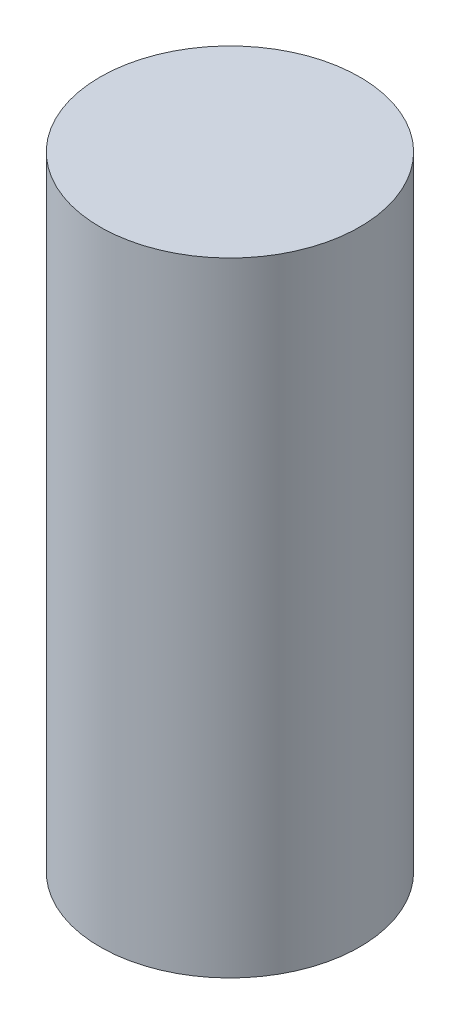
from build123d import *

# Parameters (mm, degrees)
ESQUISSE1_W = 12.5
ESQUISSE1_H = 60


with BuildPart() as part:
    # Esquisse1 → R_volution1 (revolve)
    with BuildSketch(Plane.XY, mode=Mode.PRIVATE) as r_volution1_sk:
        with Locations((6.25, -0.177955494)):
            Rectangle(ESQUISSE1_W, ESQUISSE1_H)
    revolve(r_volution1_sk.sketch.rotate(Axis((0, 29.822044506, 0), (0, -1, 0)), 180), axis=Axis((0, 29.822044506, 0), (0, -1, 0)))


solid = part.part
